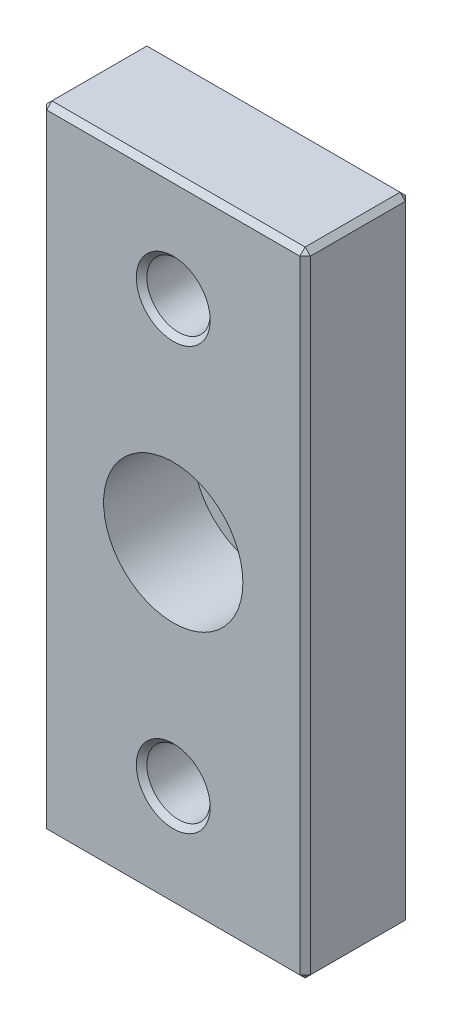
from build123d import *

# Parameters (mm, degrees)
ESQUISSE1_W             = 25
ESQUISSE1_H             = 60
ESQUISSE1_R             = 3
ESQUISSE1_R_2           = 4.1
BASE_EXTRUSION_DEPTH    = 10
CHANFREIN1_SIZE         = 0.5
ESQUISSE2_R             = 6.6
ENL_V_MAT_EXTRU_1_DEPTH = 8.5


with BuildPart() as part:
    # Esquisse1 → Base-Extrusion (new body)
    with BuildSketch(Plane.XY):
        with Locations((12.5, 30)):
            Rectangle(ESQUISSE1_W, ESQUISSE1_H)
        with Locations((12.5, 50)):
            Circle(ESQUISSE1_R, mode=Mode.SUBTRACT)
        with Locations((12.5, 10)):
            Circle(ESQUISSE1_R, mode=Mode.SUBTRACT)
        with Locations((12.5, 30)):
            Circle(ESQUISSE1_R_2, mode=Mode.SUBTRACT)
    extrude(amount=BASE_EXTRUSION_DEPTH)

    # Chanfrein1
    chanfrein1_edges = [part.edges().sort_by_distance(p)[0] for p in [
        (0, 0, 5),
        (25, 0, 5),
        (12.5, 0, 0),
        (12.5, 0, 10),
        (25, 60, 5),
        (25, 30, 0),
        (25, 30, 10),
        (0, 60, 5),
        (12.5, 60, 0),
        (12.5, 60, 10),
        (0, 30, 0),
        (0, 30, 10),
        (9.5, 50, 10),
        (9.5, 10, 10),
    ]]
    chamfer(chanfrein1_edges, length=CHANFREIN1_SIZE)

    # Esquisse2 → Enl_v. mat.-Extru.1 (cut)
    with BuildSketch(Plane.XY.offset(10)):
        with Locations((12.5, 30)):
            Circle(ESQUISSE2_R)
    extrude(amount=-ENL_V_MAT_EXTRU_1_DEPTH, mode=Mode.SUBTRACT)


solid = part.part
